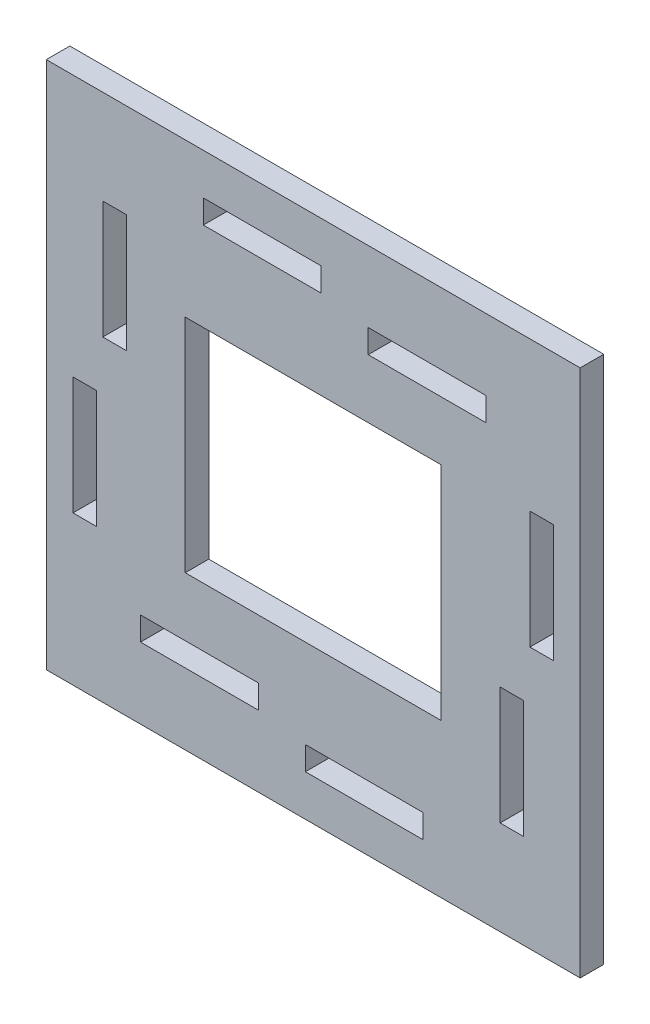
from build123d import *

# Parameters (mm, degrees)
SKETCH1_W           = 68
SKETCH1_H           = 67.3
SKETCH1_W_2         = 32.6
SKETCH1_H_2         = 28.2
SKETCH1_W_3         = 15
SKETCH1_H_3         = 3
SKETCH1_W_4         = 3
SKETCH1_H_4         = 15
BOSS_EXTRUDE1_DEPTH = 3


with BuildPart() as part:
    # Sketch1 → Boss-Extrude1 (new body)
    with BuildSketch(Plane.XY):
        Rectangle(SKETCH1_W, SKETCH1_H)
        Rectangle(SKETCH1_W_2, SKETCH1_H_2, mode=Mode.SUBTRACT)
        with Locations((14.5, 23.1)):
            Rectangle(SKETCH1_W_3, SKETCH1_H_3, mode=Mode.SUBTRACT)
        with Locations((-6.5, 26.9)):
            Rectangle(SKETCH1_W_3, SKETCH1_H_3, mode=Mode.SUBTRACT)
        with Locations((29.1, 7.15)):
            Rectangle(SKETCH1_W_4, SKETCH1_H_4, mode=Mode.SUBTRACT)
        with Locations((25.3, -14.15)):
            Rectangle(SKETCH1_W_4, SKETCH1_H_4, mode=Mode.SUBTRACT)
        with Locations((6.5, -26.9)):
            Rectangle(SKETCH1_W_3, SKETCH1_H_3, mode=Mode.SUBTRACT)
        with Locations((-14.5, -23.1)):
            Rectangle(SKETCH1_W_3, SKETCH1_H_3, mode=Mode.SUBTRACT)
        with Locations((-29.1, -7.15)):
            Rectangle(SKETCH1_W_4, SKETCH1_H_4, mode=Mode.SUBTRACT)
        with Locations((-25.3, 14.15)):
            Rectangle(SKETCH1_W_4, SKETCH1_H_4, mode=Mode.SUBTRACT)
    extrude(amount=BOSS_EXTRUDE1_DEPTH)


solid = part.part
